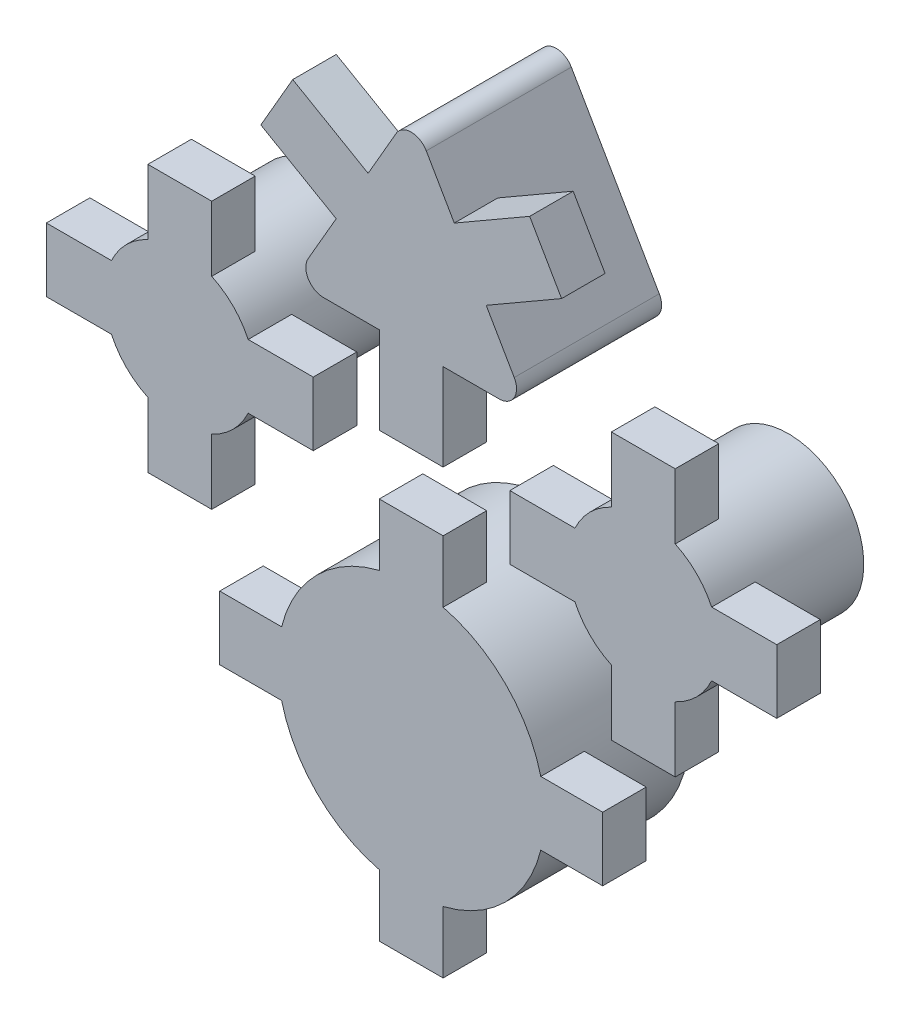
from build123d import *
from build123d.topology import SkipClean

# Parameters (mm, degrees)
BOSS_EXTRUDE1_DEPTH   = 1.905
BOSS_EXTRUDE1_2_DEPTH = 1.905
BOSS_EXTRUDE1_3_DEPTH = 1.905
BOSS_EXTRUDE1_4_DEPTH = 1.905
SKETCH2_R             = 3.302
SKETCH2_R_2           = 5.842
BOSS_EXTRUDE2_DEPTH   = 4.445


with BuildPart() as part:
    # Sketch1 → Boss-Extrude1 (new body)
    with BuildSketch(Plane.XY):
        with BuildLine():
            Line((-42.627, -37.592), (-39.776921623, -37.592))
            ThreePointArc((-39.776921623, -37.592), (-39.119866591, -38.529866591), (-38.182, -39.186921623))
            Line((-38.182, -39.186921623), (-38.182, -42.037))
            Line((-38.182, -42.037), (-35.388, -42.037))
            Line((-35.388, -42.037), (-35.388, -39.186921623))
            ThreePointArc((-35.388, -39.186921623), (-34.450133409, -38.529866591), (-33.793078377, -37.592))
            Line((-33.793078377, -37.592), (-30.943, -37.592))
            Line((-30.943, -37.592), (-30.943, -34.798))
            Line((-30.943, -34.798), (-33.793078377, -34.798))
            ThreePointArc((-33.793078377, -34.798), (-34.450133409, -33.860133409), (-35.388, -33.203078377))
            Line((-35.388, -33.203078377), (-35.388, -30.353))
            Line((-35.388, -30.353), (-38.182, -30.353))
            Line((-38.182, -30.353), (-38.182, -33.203078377))
            ThreePointArc((-38.182, -33.203078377), (-39.119866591, -33.860133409), (-39.776921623, -34.798))
            Line((-39.776921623, -34.798), (-42.627, -34.798))
            Line((-42.627, -34.798), (-42.627, -37.592))
        make_face()
    extrude(amount=-BOSS_EXTRUDE1_DEPTH)



with BuildPart() as body_2:
    # Sketch1 → Boss-Extrude1 2 (new body)
    with BuildSketch(Plane.XY):
        with BuildLine():
            Line((-22.337, -37.592), (-19.486921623, -37.592))
            ThreePointArc((-19.486921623, -37.592), (-18.829866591, -38.529866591), (-17.892, -39.186921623))
            Line((-17.892, -39.186921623), (-17.892, -42.037))
            Line((-17.892, -42.037), (-15.098, -42.037))
            Line((-15.098, -42.037), (-15.098, -39.186921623))
            ThreePointArc((-15.098, -39.186921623), (-14.160133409, -38.529866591), (-13.503078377, -37.592))
            Line((-13.503078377, -37.592), (-10.653, -37.592))
            Line((-10.653, -37.592), (-10.653, -34.798))
            Line((-10.653, -34.798), (-13.503078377, -34.798))
            ThreePointArc((-13.503078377, -34.798), (-14.160133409, -33.860133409), (-15.098, -33.203078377))
            Line((-15.098, -33.203078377), (-15.098, -30.353))
            Line((-15.098, -30.353), (-17.892, -30.353))
            Line((-17.892, -30.353), (-17.892, -33.203078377))
            ThreePointArc((-17.892, -33.203078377), (-18.829866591, -33.860133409), (-19.486921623, -34.798))
            Line((-19.486921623, -34.798), (-22.337, -34.798))
            Line((-22.337, -34.798), (-22.337, -37.592))
        make_face()
    extrude(amount=-BOSS_EXTRUDE1_2_DEPTH)


with BuildPart() as body_3:
    # Sketch1 → Boss-Extrude1 3 (new body)
    with BuildSketch(Plane.XY):
        with BuildLine():
            Line((-28.052, -37.973), (-28.052, -40.682491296))
            ThreePointArc((-28.052, -40.682491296), (-30.785917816, -42.224082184), (-32.327508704, -44.958))
            Line((-32.327508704, -44.958), (-35.037, -44.958))
            Line((-35.037, -44.958), (-35.037, -47.752))
            Line((-35.037, -47.752), (-32.327508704, -47.752))
            ThreePointArc((-32.327508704, -47.752), (-30.785917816, -50.485917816), (-28.052, -52.027508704))
            Line((-28.052, -52.027508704), (-28.052, -54.737))
            Line((-28.052, -54.737), (-25.258, -54.737))
            Line((-25.258, -54.737), (-25.258, -52.027508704))
            ThreePointArc((-25.258, -52.027508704), (-22.524082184, -50.485917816), (-20.982491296, -47.752))
            Line((-20.982491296, -47.752), (-18.273, -47.752))
            Line((-18.273, -47.752), (-18.273, -44.958))
            Line((-18.273, -44.958), (-20.982491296, -44.958))
            ThreePointArc((-20.982491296, -44.958), (-22.524082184, -42.224082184), (-25.258, -40.682491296))
            Line((-25.258, -40.682491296), (-25.258, -37.973))
            Line((-25.258, -37.973), (-28.052, -37.973))
        make_face()
    extrude(amount=-BOSS_EXTRUDE1_3_DEPTH)


with BuildPart() as body_4:
    # Sketch1 → Boss-Extrude1 4 (new body)
    with BuildSketch(Plane.XY):
        with BuildLine():
            Line((-25.258, -31.5595), (-22.80551708, -31.5595))
            ThreePointArc((-22.80551708, -31.5595), (-22.145605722, -31.1785), (-22.145605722, -30.4165))
            Line((-22.145605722, -30.4165), (-23.371847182, -28.292587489))
            Line((-23.371847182, -28.292587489), (-20.072290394, -26.387587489))
            Line((-20.072290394, -26.387587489), (-21.469290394, -23.967912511))
            Line((-21.469290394, -23.967912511), (-24.768847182, -25.872912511))
            Line((-24.768847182, -25.872912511), (-25.995088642, -23.749))
            ThreePointArc((-25.995088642, -23.749), (-26.655, -23.368), (-27.314911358, -23.749))
            Line((-27.314911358, -23.749), (-28.541152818, -25.872912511))
            Line((-28.541152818, -25.872912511), (-31.840709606, -23.967912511))
            Line((-31.840709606, -23.967912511), (-33.237709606, -26.387587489))
            Line((-33.237709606, -26.387587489), (-29.938152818, -28.292587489))
            Line((-29.938152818, -28.292587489), (-31.164394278, -30.4165))
            ThreePointArc((-31.164394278, -30.4165), (-31.164394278, -31.1785), (-30.50448292, -31.5595))
            Line((-30.50448292, -31.5595), (-28.052, -31.5595))
            Line((-28.052, -31.5595), (-28.052, -35.3695))
            Line((-28.052, -35.3695), (-25.258, -35.3695))
            Line((-25.258, -35.3695), (-25.258, -31.5595))
        make_face()
    extrude(amount=-BOSS_EXTRUDE1_4_DEPTH)


with BuildPart() as part_1:
    with SkipClean():  # the faces are left unmerged after this step: merging them gives an invalid solid
        add(part.part)

        add(body_2.part)  # Boss-Extrude2 merges body 2

        add(body_3.part)  # Boss-Extrude2 merges body 3

        add(body_4.part)  # Boss-Extrude2 merges body 4
        # Sketch2 → Boss-Extrude2 (add)
        with BuildSketch(Plane(origin=(0, 0, -1.905), x_dir=(-1, 0, 0), z_dir=(0, 0, -1))):
            with Locations(Location((36.785, -36.195, 0), (0, 0, 154.971000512))):
                Circle(SKETCH2_R)
            with Locations(Location((26.655, -46.355, 0), (0, 0, 166.164776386))):
                Circle(SKETCH2_R_2)
            with Locations(Location((16.495, -36.195, 0), (0, 0, 154.971000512))):
                Circle(SKETCH2_R)
            with BuildLine():
                Line((23.371847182, -28.292587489), (22.145605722, -30.4165))
                ThreePointArc((22.145605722, -30.4165), (22.145605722, -31.1785), (22.80551708, -31.5595))
                Line((22.80551708, -31.5595), (28.052, -31.5595))
                Line((28.052, -31.5595), (30.50448292, -31.5595))
                ThreePointArc((30.50448292, -31.5595), (31.164394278, -31.1785), (31.164394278, -30.4165))
                Line((31.164394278, -30.4165), (28.541152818, -25.872912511))
                Line((28.541152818, -25.872912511), (27.314911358, -23.749))
                ThreePointArc((27.314911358, -23.749), (26.655, -23.368), (25.995088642, -23.749))
                Line((25.995088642, -23.749), (23.371847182, -28.292587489))
            make_face()
        extrude(amount=BOSS_EXTRUDE2_DEPTH)


solid = part_1.part
